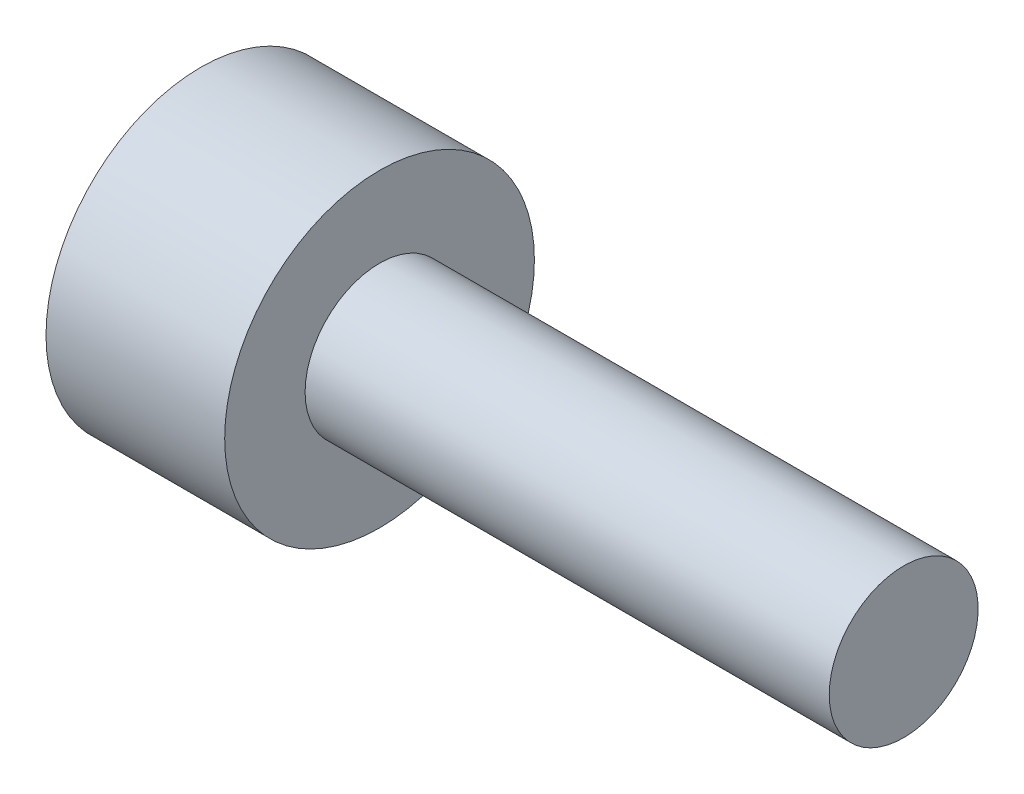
ISO-10303-21;
HEADER;
FILE_DESCRIPTION(('STEP AP214'),'2;1');
FILE_NAME('part.step','',(''),(''),'','','');
FILE_SCHEMA(('AUTOMOTIVE_DESIGN { 1 0 10303 214 1 1 1 1 }'));
ENDSEC;
DATA;
#1=APPLICATION_CONTEXT('core data for automotive mechanical design processes');
#2=APPLICATION_PROTOCOL_DEFINITION('international standard','automotive_design',2000,#1);
#3=PRODUCT_CONTEXT('',#1,'mechanical');
#4=PRODUCT('Part','Part','',(#3));
#5=PRODUCT_RELATED_PRODUCT_CATEGORY('part','',(#4));
#6=PRODUCT_DEFINITION_FORMATION('','',#4);
#7=PRODUCT_DEFINITION_CONTEXT('part definition',#1,'design');
#8=PRODUCT_DEFINITION('design','',#6,#7);
#9=PRODUCT_DEFINITION_SHAPE('','',#8);
#10=(LENGTH_UNIT() NAMED_UNIT(*) SI_UNIT(.MILLI.,.METRE.));
#11=(NAMED_UNIT(*) PLANE_ANGLE_UNIT() SI_UNIT($,.RADIAN.));
#12=(NAMED_UNIT(*) SI_UNIT($,.STERADIAN.) SOLID_ANGLE_UNIT());
#13=UNCERTAINTY_MEASURE_WITH_UNIT(LENGTH_MEASURE(1.E-05),#10,'distance_accuracy_value','');
#14=(GEOMETRIC_REPRESENTATION_CONTEXT(3) GLOBAL_UNCERTAINTY_ASSIGNED_CONTEXT((#13)) GLOBAL_UNIT_ASSIGNED_CONTEXT((#10,
#11,#12)) REPRESENTATION_CONTEXT('',''));
#15=CARTESIAN_POINT('',(0.,0.,0.));
#16=DIRECTION('',(0.,0.,1.));
#17=DIRECTION('',(1.,0.,0.));
#18=AXIS2_PLACEMENT_3D('',#15,#16,#17);
#19=CARTESIAN_POINT('',(0.,0.,0.));
#20=DIRECTION('',(1.,0.,0.));
#21=DIRECTION('',(0.,0.,-1.));
#22=AXIS2_PLACEMENT_3D('',#19,#20,#21);
#23=PLANE('',#22);
#24=CARTESIAN_POINT('',(0.,0.,0.));
#25=DIRECTION('',(-1.,0.,0.));
#26=DIRECTION('',(0.,0.,1.));
#27=AXIS2_PLACEMENT_3D('',#24,#25,#26);
#28=CIRCLE('',#27,0.15);
#29=CARTESIAN_POINT('',(0.,0.,0.15));
#30=VERTEX_POINT('',#29);
#31=EDGE_CURVE('E36',#30,#30,#28,.T.);
#32=ORIENTED_EDGE('',*,*,#31,.F.);
#33=EDGE_LOOP('',(#32));
#34=FACE_BOUND('',#33,.T.);
#35=CARTESIAN_POINT('',(0.,0.,0.));
#36=DIRECTION('',(-1.,0.,0.));
#37=DIRECTION('',(0.,0.,1.));
#38=AXIS2_PLACEMENT_3D('',#35,#36,#37);
#39=CIRCLE('',#38,2.6);
#40=CARTESIAN_POINT('',(0.,0.,2.6));
#41=VERTEX_POINT('',#40);
#42=EDGE_CURVE('E9',#41,#41,#39,.T.);
#43=ORIENTED_EDGE('',*,*,#42,.T.);
#44=EDGE_LOOP('',(#43));
#45=FACE_BOUND('',#44,.T.);
#46=ADVANCED_FACE('F14',(#34,#45),#23,.F.);
#47=CARTESIAN_POINT('',(0.,0.,0.));
#48=DIRECTION('',(-1.,0.,0.));
#49=DIRECTION('',(0.,0.,1.));
#50=AXIS2_PLACEMENT_3D('',#47,#48,#49);
#51=CYLINDRICAL_SURFACE('',#50,2.6);
#52=ORIENTED_EDGE('',*,*,#42,.F.);
#53=EDGE_LOOP('',(#52));
#54=FACE_BOUND('',#53,.T.);
#55=CARTESIAN_POINT('',(3.,0.,0.));
#56=DIRECTION('',(-1.,0.,0.));
#57=DIRECTION('',(0.,0.,1.));
#58=AXIS2_PLACEMENT_3D('',#55,#56,#57);
#59=CIRCLE('',#58,2.6);
#60=CARTESIAN_POINT('',(3.,0.,2.6));
#61=VERTEX_POINT('',#60);
#62=EDGE_CURVE('E20',#61,#61,#59,.T.);
#63=ORIENTED_EDGE('',*,*,#62,.T.);
#64=EDGE_LOOP('',(#63));
#65=FACE_BOUND('',#64,.T.);
#66=ADVANCED_FACE('F43',(#54,#65),#51,.T.);
#67=CARTESIAN_POINT('',(3.,2.6,0.));
#68=DIRECTION('',(-1.,0.,0.));
#69=DIRECTION('',(0.,0.,1.));
#70=AXIS2_PLACEMENT_3D('',#67,#68,#69);
#71=PLANE('',#70);
#72=ORIENTED_EDGE('',*,*,#62,.F.);
#73=EDGE_LOOP('',(#72));
#74=FACE_BOUND('',#73,.T.);
#75=CARTESIAN_POINT('',(3.,0.,0.));
#76=DIRECTION('',(-1.,0.,0.));
#77=DIRECTION('',(0.,0.,1.));
#78=AXIS2_PLACEMENT_3D('',#75,#76,#77);
#79=CIRCLE('',#78,1.25);
#80=CARTESIAN_POINT('',(3.,0.,1.25));
#81=VERTEX_POINT('',#80);
#82=EDGE_CURVE('E24',#81,#81,#79,.T.);
#83=ORIENTED_EDGE('',*,*,#82,.T.);
#84=EDGE_LOOP('',(#83));
#85=FACE_BOUND('',#84,.T.);
#86=ADVANCED_FACE('F49',(#74,#85),#71,.F.);
#87=CARTESIAN_POINT('',(0.,0.,0.));
#88=DIRECTION('',(-1.,0.,0.));
#89=DIRECTION('',(0.,0.,1.));
#90=AXIS2_PLACEMENT_3D('',#87,#88,#89);
#91=CYLINDRICAL_SURFACE('',#90,1.25);
#92=ORIENTED_EDGE('',*,*,#82,.F.);
#93=EDGE_LOOP('',(#92));
#94=FACE_BOUND('',#93,.T.);
#95=CARTESIAN_POINT('',(11.8,0.,0.));
#96=DIRECTION('',(-1.,0.,0.));
#97=DIRECTION('',(0.,0.,1.));
#98=AXIS2_PLACEMENT_3D('',#95,#96,#97);
#99=CIRCLE('',#98,1.25);
#100=CARTESIAN_POINT('',(11.8,0.,1.25));
#101=VERTEX_POINT('',#100);
#102=EDGE_CURVE('E28',#101,#101,#99,.T.);
#103=ORIENTED_EDGE('',*,*,#102,.T.);
#104=EDGE_LOOP('',(#103));
#105=FACE_BOUND('',#104,.T.);
#106=ADVANCED_FACE('F55',(#94,#105),#91,.T.);
#107=CARTESIAN_POINT('',(11.8,1.25,0.));
#108=DIRECTION('',(-1.,0.,0.));
#109=DIRECTION('',(0.,0.,1.));
#110=AXIS2_PLACEMENT_3D('',#107,#108,#109);
#111=PLANE('',#110);
#112=ORIENTED_EDGE('',*,*,#102,.F.);
#113=EDGE_LOOP('',(#112));
#114=FACE_BOUND('',#113,.T.);
#115=ADVANCED_FACE('F61',(#114),#111,.F.);
#116=CARTESIAN_POINT('',(0.,0.,0.));
#117=DIRECTION('',(-1.,0.,0.));
#118=DIRECTION('',(0.,0.,1.));
#119=AXIS2_PLACEMENT_3D('',#116,#117,#118);
#120=CONICAL_SURFACE('',#119,0.15,0.26179938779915);
#121=CARTESIAN_POINT('',(0.3,0.,0.));
#122=DIRECTION('',(-1.,0.,0.));
#123=DIRECTION('',(0.,0.,1.));
#124=AXIS2_PLACEMENT_3D('',#121,#122,#123);
#125=CIRCLE('',#124,0.069615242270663);
#126=CARTESIAN_POINT('',(0.3,0.,0.069615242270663));
#127=VERTEX_POINT('',#126);
#128=EDGE_CURVE('E33',#127,#127,#125,.T.);
#129=ORIENTED_EDGE('',*,*,#128,.F.);
#130=EDGE_LOOP('',(#129));
#131=FACE_BOUND('',#130,.T.);
#132=ORIENTED_EDGE('',*,*,#31,.T.);
#133=EDGE_LOOP('',(#132));
#134=FACE_BOUND('',#133,.T.);
#135=ADVANCED_FACE('F40',(#131,#134),#120,.F.);
#136=CARTESIAN_POINT('',(0.3,0.,0.));
#137=DIRECTION('',(-1.,0.,0.));
#138=DIRECTION('',(0.,0.,1.));
#139=AXIS2_PLACEMENT_3D('',#136,#137,#138);
#140=PLANE('',#139);
#141=ORIENTED_EDGE('',*,*,#128,.T.);
#142=EDGE_LOOP('',(#141));
#143=FACE_BOUND('',#142,.T.);
#144=ADVANCED_FACE('F68',(#143),#140,.T.);
#145=CLOSED_SHELL('',(#46,#66,#86,#106,#115,#135,#144));
#146=MANIFOLD_SOLID_BREP('B1',#145);
#147=ADVANCED_BREP_SHAPE_REPRESENTATION('',(#18,#146),#14);
#148=SHAPE_DEFINITION_REPRESENTATION(#9,#147);
ENDSEC;
END-ISO-10303-21;
